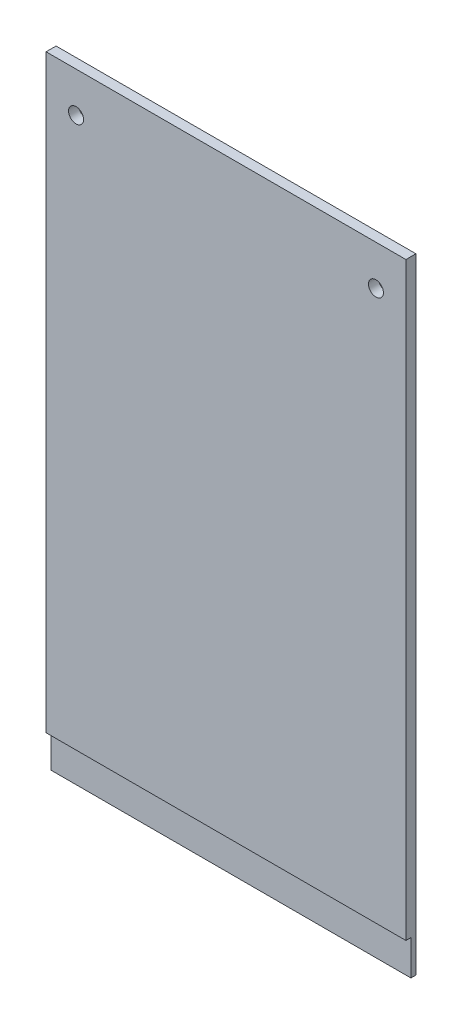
ISO-10303-21;
HEADER;
FILE_DESCRIPTION(('STEP AP214'),'2;1');
FILE_NAME('part.step','',(''),(''),'','','');
FILE_SCHEMA(('AUTOMOTIVE_DESIGN { 1 0 10303 214 1 1 1 1 }'));
ENDSEC;
DATA;
#1=APPLICATION_CONTEXT('core data for automotive mechanical design processes');
#2=APPLICATION_PROTOCOL_DEFINITION('international standard','automotive_design',2000,#1);
#3=PRODUCT_CONTEXT('',#1,'mechanical');
#4=PRODUCT('Part','Part','',(#3));
#5=PRODUCT_RELATED_PRODUCT_CATEGORY('part','',(#4));
#6=PRODUCT_DEFINITION_FORMATION('','',#4);
#7=PRODUCT_DEFINITION_CONTEXT('part definition',#1,'design');
#8=PRODUCT_DEFINITION('design','',#6,#7);
#9=PRODUCT_DEFINITION_SHAPE('','',#8);
#10=(LENGTH_UNIT() NAMED_UNIT(*) SI_UNIT(.MILLI.,.METRE.));
#11=(NAMED_UNIT(*) PLANE_ANGLE_UNIT() SI_UNIT($,.RADIAN.));
#12=(NAMED_UNIT(*) SI_UNIT($,.STERADIAN.) SOLID_ANGLE_UNIT());
#13=UNCERTAINTY_MEASURE_WITH_UNIT(LENGTH_MEASURE(1.E-05),#10,'distance_accuracy_value','');
#14=(GEOMETRIC_REPRESENTATION_CONTEXT(3) GLOBAL_UNCERTAINTY_ASSIGNED_CONTEXT((#13)) GLOBAL_UNIT_ASSIGNED_CONTEXT((#10,
#11,#12)) REPRESENTATION_CONTEXT('',''));
#15=CARTESIAN_POINT('',(0.,0.,0.));
#16=DIRECTION('',(0.,0.,1.));
#17=DIRECTION('',(1.,0.,0.));
#18=AXIS2_PLACEMENT_3D('',#15,#16,#17);
#19=CARTESIAN_POINT('',(36.,122.,2.));
#20=DIRECTION('',(-1.,0.,0.));
#21=DIRECTION('',(0.,-1.,0.));
#22=AXIS2_PLACEMENT_3D('',#19,#20,#21);
#23=PLANE('',#22);
#24=DIRECTION('',(0.,1.,0.));
#25=VECTOR('',#24,1.);
#26=CARTESIAN_POINT('',(36.,122.,2.));
#27=LINE('',#26,#25);
#28=CARTESIAN_POINT('',(36.,3.99999999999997,2.));
#29=VERTEX_POINT('',#28);
#30=CARTESIAN_POINT('',(36.,122.,2.));
#31=VERTEX_POINT('',#30);
#32=EDGE_CURVE('E135',#29,#31,#27,.T.);
#33=ORIENTED_EDGE('',*,*,#32,.F.);
#34=DIRECTION('',(0.,0.,1.));
#35=VECTOR('',#34,1.);
#36=CARTESIAN_POINT('',(36.,3.99999999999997,0.999999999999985));
#37=LINE('',#36,#35);
#38=CARTESIAN_POINT('',(36.,3.99999999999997,0.999999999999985));
#39=VERTEX_POINT('',#38);
#40=EDGE_CURVE('E109',#39,#29,#37,.T.);
#41=ORIENTED_EDGE('',*,*,#40,.F.);
#42=DIRECTION('',(0.,1.,0.));
#43=VECTOR('',#42,1.);
#44=CARTESIAN_POINT('',(36.,-3.00000000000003,0.999999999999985));
#45=LINE('',#44,#43);
#46=CARTESIAN_POINT('',(36.,-3.00000000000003,0.999999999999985));
#47=VERTEX_POINT('',#46);
#48=EDGE_CURVE('E93',#47,#39,#45,.T.);
#49=ORIENTED_EDGE('',*,*,#48,.F.);
#50=DIRECTION('',(0.,0.,1.));
#51=VECTOR('',#50,1.);
#52=CARTESIAN_POINT('',(36.,-3.00000000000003,0.));
#53=LINE('',#52,#51);
#54=CARTESIAN_POINT('',(36.,-3.00000000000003,0.));
#55=VERTEX_POINT('',#54);
#56=EDGE_CURVE('E118',#55,#47,#53,.T.);
#57=ORIENTED_EDGE('',*,*,#56,.F.);
#58=DIRECTION('',(0.,1.,0.));
#59=VECTOR('',#58,1.);
#60=CARTESIAN_POINT('',(36.,122.,0.));
#61=LINE('',#60,#59);
#62=CARTESIAN_POINT('',(36.,122.,0.));
#63=VERTEX_POINT('',#62);
#64=EDGE_CURVE('E132',#55,#63,#61,.T.);
#65=ORIENTED_EDGE('',*,*,#64,.T.);
#66=DIRECTION('',(0.,0.,-1.));
#67=VECTOR('',#66,1.);
#68=CARTESIAN_POINT('',(36.,122.,2.));
#69=LINE('',#68,#67);
#70=EDGE_CURVE('E11',#31,#63,#69,.T.);
#71=ORIENTED_EDGE('',*,*,#70,.F.);
#72=EDGE_LOOP('',(#33,#41,#49,#57,#65,#71));
#73=FACE_BOUND('',#72,.T.);
#74=ADVANCED_FACE('F39',(#73),#23,.F.);
#75=CARTESIAN_POINT('',(-36.,122.,2.));
#76=DIRECTION('',(0.,-1.,0.));
#77=DIRECTION('',(0.,0.,-1.));
#78=AXIS2_PLACEMENT_3D('',#75,#76,#77);
#79=PLANE('',#78);
#80=DIRECTION('',(-1.,0.,0.));
#81=VECTOR('',#80,1.);
#82=CARTESIAN_POINT('',(-36.,122.,0.));
#83=LINE('',#82,#81);
#84=CARTESIAN_POINT('',(-36.,122.,0.));
#85=VERTEX_POINT('',#84);
#86=EDGE_CURVE('E143',#63,#85,#83,.T.);
#87=ORIENTED_EDGE('',*,*,#86,.T.);
#88=DIRECTION('',(0.,0.,-1.));
#89=VECTOR('',#88,1.);
#90=CARTESIAN_POINT('',(-36.,122.,2.));
#91=LINE('',#90,#89);
#92=CARTESIAN_POINT('',(-36.,122.,2.));
#93=VERTEX_POINT('',#92);
#94=EDGE_CURVE('E46',#93,#85,#91,.T.);
#95=ORIENTED_EDGE('',*,*,#94,.F.);
#96=DIRECTION('',(-1.,0.,0.));
#97=VECTOR('',#96,1.);
#98=CARTESIAN_POINT('',(-36.,122.,2.));
#99=LINE('',#98,#97);
#100=EDGE_CURVE('E137',#31,#93,#99,.T.);
#101=ORIENTED_EDGE('',*,*,#100,.F.);
#102=ORIENTED_EDGE('',*,*,#70,.T.);
#103=EDGE_LOOP('',(#87,#95,#101,#102));
#104=FACE_BOUND('',#103,.T.);
#105=ADVANCED_FACE('F162',(#104),#79,.F.);
#106=CARTESIAN_POINT('',(-36.,122.,2.));
#107=DIRECTION('',(1.,0.,0.));
#108=DIRECTION('',(0.,1.,0.));
#109=AXIS2_PLACEMENT_3D('',#106,#107,#108);
#110=PLANE('',#109);
#111=DIRECTION('',(0.,1.,0.));
#112=VECTOR('',#111,1.);
#113=CARTESIAN_POINT('',(-36.,-3.00000000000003,0.999999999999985));
#114=LINE('',#113,#112);
#115=CARTESIAN_POINT('',(-36.,-3.00000000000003,0.999999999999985));
#116=VERTEX_POINT('',#115);
#117=CARTESIAN_POINT('',(-36.,3.99999999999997,0.999999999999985));
#118=VERTEX_POINT('',#117);
#119=EDGE_CURVE('E53',#116,#118,#114,.T.);
#120=ORIENTED_EDGE('',*,*,#119,.T.);
#121=DIRECTION('',(0.,0.,1.));
#122=VECTOR('',#121,1.);
#123=CARTESIAN_POINT('',(-36.,3.99999999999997,0.999999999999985));
#124=LINE('',#123,#122);
#125=CARTESIAN_POINT('',(-36.,3.99999999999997,2.));
#126=VERTEX_POINT('',#125);
#127=EDGE_CURVE('E100',#118,#126,#124,.T.);
#128=ORIENTED_EDGE('',*,*,#127,.T.);
#129=DIRECTION('',(0.,-1.,0.));
#130=VECTOR('',#129,1.);
#131=CARTESIAN_POINT('',(-36.,122.,2.));
#132=LINE('',#131,#130);
#133=EDGE_CURVE('E140',#93,#126,#132,.T.);
#134=ORIENTED_EDGE('',*,*,#133,.F.);
#135=ORIENTED_EDGE('',*,*,#94,.T.);
#136=DIRECTION('',(0.,-1.,0.));
#137=VECTOR('',#136,1.);
#138=CARTESIAN_POINT('',(-36.,122.,0.));
#139=LINE('',#138,#137);
#140=CARTESIAN_POINT('',(-36.,-3.,0.));
#141=VERTEX_POINT('',#140);
#142=EDGE_CURVE('E138',#85,#141,#139,.T.);
#143=ORIENTED_EDGE('',*,*,#142,.T.);
#144=DIRECTION('',(0.,0.,1.));
#145=VECTOR('',#144,1.);
#146=CARTESIAN_POINT('',(-36.,-3.00000000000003,0.));
#147=LINE('',#146,#145);
#148=EDGE_CURVE('E60',#141,#116,#147,.T.);
#149=ORIENTED_EDGE('',*,*,#148,.T.);
#150=EDGE_LOOP('',(#120,#128,#134,#135,#143,#149));
#151=FACE_BOUND('',#150,.T.);
#152=ADVANCED_FACE('F107',(#151),#110,.F.);
#153=CARTESIAN_POINT('',(0.,0.,2.));
#154=DIRECTION('',(0.,0.,1.));
#155=DIRECTION('',(1.,0.,0.));
#156=AXIS2_PLACEMENT_3D('',#153,#154,#155);
#157=PLANE('',#156);
#158=DIRECTION('',(1.,0.,0.));
#159=VECTOR('',#158,1.);
#160=CARTESIAN_POINT('',(-36.,3.99999999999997,2.));
#161=LINE('',#160,#159);
#162=EDGE_CURVE('E96',#126,#29,#161,.T.);
#163=ORIENTED_EDGE('',*,*,#162,.T.);
#164=ORIENTED_EDGE('',*,*,#32,.T.);
#165=ORIENTED_EDGE('',*,*,#100,.T.);
#166=ORIENTED_EDGE('',*,*,#133,.T.);
#167=EDGE_LOOP('',(#163,#164,#165,#166));
#168=FACE_BOUND('',#167,.T.);
#169=CARTESIAN_POINT('',(-30.,114.,2.));
#170=DIRECTION('',(0.,0.,1.));
#171=DIRECTION('',(1.,0.,0.));
#172=AXIS2_PLACEMENT_3D('',#169,#170,#171);
#173=CIRCLE('',#172,1.5);
#174=CARTESIAN_POINT('',(-28.5,114.,2.));
#175=VERTEX_POINT('',#174);
#176=EDGE_CURVE('E123',#175,#175,#173,.T.);
#177=ORIENTED_EDGE('',*,*,#176,.F.);
#178=EDGE_LOOP('',(#177));
#179=FACE_BOUND('',#178,.T.);
#180=CARTESIAN_POINT('',(30.,114.,2.));
#181=DIRECTION('',(0.,0.,1.));
#182=DIRECTION('',(1.,0.,0.));
#183=AXIS2_PLACEMENT_3D('',#180,#181,#182);
#184=CIRCLE('',#183,1.5);
#185=CARTESIAN_POINT('',(31.5,114.,2.));
#186=VERTEX_POINT('',#185);
#187=EDGE_CURVE('E126',#186,#186,#184,.T.);
#188=ORIENTED_EDGE('',*,*,#187,.F.);
#189=EDGE_LOOP('',(#188));
#190=FACE_BOUND('',#189,.T.);
#191=ADVANCED_FACE('F160',(#168,#179,#190),#157,.T.);
#192=CARTESIAN_POINT('',(0.,0.,0.));
#193=DIRECTION('',(0.,0.,1.));
#194=DIRECTION('',(1.,0.,0.));
#195=AXIS2_PLACEMENT_3D('',#192,#193,#194);
#196=PLANE('',#195);
#197=CARTESIAN_POINT('',(-30.,114.,0.));
#198=DIRECTION('',(0.,0.,1.));
#199=DIRECTION('',(1.,0.,0.));
#200=AXIS2_PLACEMENT_3D('',#197,#198,#199);
#201=CIRCLE('',#200,1.5);
#202=CARTESIAN_POINT('',(-28.5,114.,0.));
#203=VERTEX_POINT('',#202);
#204=EDGE_CURVE('E120',#203,#203,#201,.T.);
#205=ORIENTED_EDGE('',*,*,#204,.T.);
#206=EDGE_LOOP('',(#205));
#207=FACE_BOUND('',#206,.T.);
#208=CARTESIAN_POINT('',(30.,114.,0.));
#209=DIRECTION('',(0.,0.,1.));
#210=DIRECTION('',(1.,0.,0.));
#211=AXIS2_PLACEMENT_3D('',#208,#209,#210);
#212=CIRCLE('',#211,1.5);
#213=CARTESIAN_POINT('',(31.5,114.,0.));
#214=VERTEX_POINT('',#213);
#215=EDGE_CURVE('E129',#214,#214,#212,.T.);
#216=ORIENTED_EDGE('',*,*,#215,.T.);
#217=EDGE_LOOP('',(#216));
#218=FACE_BOUND('',#217,.T.);
#219=ORIENTED_EDGE('',*,*,#64,.F.);
#220=DIRECTION('',(-1.,0.,0.));
#221=VECTOR('',#220,1.);
#222=CARTESIAN_POINT('',(-36.,-3.00000000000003,0.));
#223=LINE('',#222,#221);
#224=EDGE_CURVE('E114',#55,#141,#223,.T.);
#225=ORIENTED_EDGE('',*,*,#224,.T.);
#226=ORIENTED_EDGE('',*,*,#142,.F.);
#227=ORIENTED_EDGE('',*,*,#86,.F.);
#228=EDGE_LOOP('',(#219,#225,#226,#227));
#229=FACE_BOUND('',#228,.T.);
#230=ADVANCED_FACE('F153',(#207,#218,#229),#196,.F.);
#231=CARTESIAN_POINT('',(30.,114.,0.));
#232=DIRECTION('',(0.,0.,1.));
#233=DIRECTION('',(1.,0.,0.));
#234=AXIS2_PLACEMENT_3D('',#231,#232,#233);
#235=CYLINDRICAL_SURFACE('',#234,1.5);
#236=ORIENTED_EDGE('',*,*,#215,.F.);
#237=EDGE_LOOP('',(#236));
#238=FACE_BOUND('',#237,.T.);
#239=ORIENTED_EDGE('',*,*,#187,.T.);
#240=EDGE_LOOP('',(#239));
#241=FACE_BOUND('',#240,.T.);
#242=ADVANCED_FACE('F172',(#238,#241),#235,.F.);
#243=CARTESIAN_POINT('',(-30.,114.,0.));
#244=DIRECTION('',(0.,0.,1.));
#245=DIRECTION('',(1.,0.,0.));
#246=AXIS2_PLACEMENT_3D('',#243,#244,#245);
#247=CYLINDRICAL_SURFACE('',#246,1.5);
#248=ORIENTED_EDGE('',*,*,#204,.F.);
#249=EDGE_LOOP('',(#248));
#250=FACE_BOUND('',#249,.T.);
#251=ORIENTED_EDGE('',*,*,#176,.T.);
#252=EDGE_LOOP('',(#251));
#253=FACE_BOUND('',#252,.T.);
#254=ADVANCED_FACE('F178',(#250,#253),#247,.F.);
#255=CARTESIAN_POINT('',(-36.,-3.00000000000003,0.));
#256=DIRECTION('',(0.,1.,0.));
#257=DIRECTION('',(-1.,0.,0.));
#258=AXIS2_PLACEMENT_3D('',#255,#256,#257);
#259=PLANE('',#258);
#260=ORIENTED_EDGE('',*,*,#56,.T.);
#261=DIRECTION('',(1.,0.,0.));
#262=VECTOR('',#261,1.);
#263=CARTESIAN_POINT('',(-36.,-3.00000000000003,0.999999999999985));
#264=LINE('',#263,#262);
#265=EDGE_CURVE('E97',#116,#47,#264,.T.);
#266=ORIENTED_EDGE('',*,*,#265,.F.);
#267=ORIENTED_EDGE('',*,*,#148,.F.);
#268=ORIENTED_EDGE('',*,*,#224,.F.);
#269=EDGE_LOOP('',(#260,#266,#267,#268));
#270=FACE_BOUND('',#269,.T.);
#271=ADVANCED_FACE('F155',(#270),#259,.F.);
#272=CARTESIAN_POINT('',(-36.,3.99999999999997,0.999999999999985));
#273=DIRECTION('',(0.,1.,0.));
#274=DIRECTION('',(-1.,0.,0.));
#275=AXIS2_PLACEMENT_3D('',#272,#273,#274);
#276=PLANE('',#275);
#277=ORIENTED_EDGE('',*,*,#40,.T.);
#278=ORIENTED_EDGE('',*,*,#162,.F.);
#279=ORIENTED_EDGE('',*,*,#127,.F.);
#280=DIRECTION('',(1.,0.,0.));
#281=VECTOR('',#280,1.);
#282=CARTESIAN_POINT('',(-36.,3.99999999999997,0.999999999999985));
#283=LINE('',#282,#281);
#284=EDGE_CURVE('E89',#118,#39,#283,.T.);
#285=ORIENTED_EDGE('',*,*,#284,.T.);
#286=EDGE_LOOP('',(#277,#278,#279,#285));
#287=FACE_BOUND('',#286,.T.);
#288=ADVANCED_FACE('F101',(#287),#276,.F.);
#289=CARTESIAN_POINT('',(-36.,-3.00000000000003,0.999999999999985));
#290=DIRECTION('',(0.,0.,-1.));
#291=DIRECTION('',(-1.,0.,0.));
#292=AXIS2_PLACEMENT_3D('',#289,#290,#291);
#293=PLANE('',#292);
#294=ORIENTED_EDGE('',*,*,#48,.T.);
#295=ORIENTED_EDGE('',*,*,#284,.F.);
#296=ORIENTED_EDGE('',*,*,#119,.F.);
#297=ORIENTED_EDGE('',*,*,#265,.T.);
#298=EDGE_LOOP('',(#294,#295,#296,#297));
#299=FACE_BOUND('',#298,.T.);
#300=ADVANCED_FACE('F91',(#299),#293,.F.);
#301=CLOSED_SHELL('',(#74,#105,#152,#191,#230,#242,#254,#271,#288,#300));
#302=MANIFOLD_SOLID_BREP('B2',#301);
#303=ADVANCED_BREP_SHAPE_REPRESENTATION('',(#18,#302),#14);
#304=SHAPE_DEFINITION_REPRESENTATION(#9,#303);
ENDSEC;
END-ISO-10303-21;
